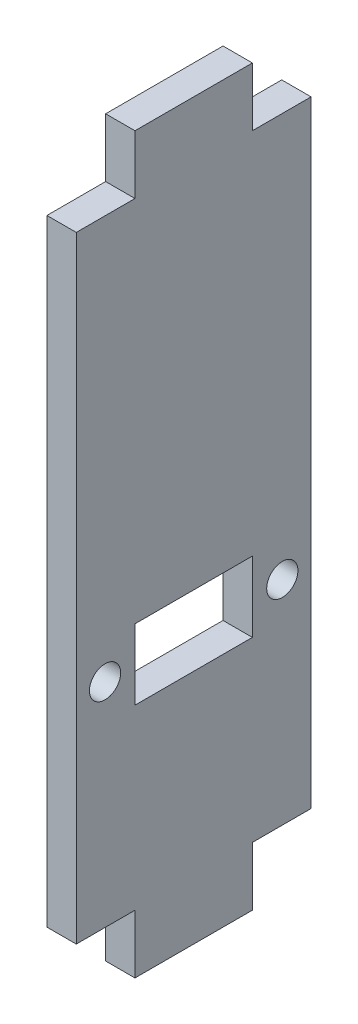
ISO-10303-21;
HEADER;
FILE_DESCRIPTION(('STEP AP214'),'2;1');
FILE_NAME('part.step','',(''),(''),'','','');
FILE_SCHEMA(('AUTOMOTIVE_DESIGN { 1 0 10303 214 1 1 1 1 }'));
ENDSEC;
DATA;
#1=APPLICATION_CONTEXT('core data for automotive mechanical design processes');
#2=APPLICATION_PROTOCOL_DEFINITION('international standard','automotive_design',2000,#1);
#3=PRODUCT_CONTEXT('',#1,'mechanical');
#4=PRODUCT('Part','Part','',(#3));
#5=PRODUCT_RELATED_PRODUCT_CATEGORY('part','',(#4));
#6=PRODUCT_DEFINITION_FORMATION('','',#4);
#7=PRODUCT_DEFINITION_CONTEXT('part definition',#1,'design');
#8=PRODUCT_DEFINITION('design','',#6,#7);
#9=PRODUCT_DEFINITION_SHAPE('','',#8);
#10=(LENGTH_UNIT() NAMED_UNIT(*) SI_UNIT(.MILLI.,.METRE.));
#11=(NAMED_UNIT(*) PLANE_ANGLE_UNIT() SI_UNIT($,.RADIAN.));
#12=(NAMED_UNIT(*) SI_UNIT($,.STERADIAN.) SOLID_ANGLE_UNIT());
#13=UNCERTAINTY_MEASURE_WITH_UNIT(LENGTH_MEASURE(1.E-05),#10,'distance_accuracy_value','');
#14=(GEOMETRIC_REPRESENTATION_CONTEXT(3) GLOBAL_UNCERTAINTY_ASSIGNED_CONTEXT((#13)) GLOBAL_UNIT_ASSIGNED_CONTEXT((#10,
#11,#12)) REPRESENTATION_CONTEXT('',''));
#15=CARTESIAN_POINT('',(0.,0.,0.));
#16=DIRECTION('',(0.,0.,1.));
#17=DIRECTION('',(1.,0.,0.));
#18=AXIS2_PLACEMENT_3D('',#15,#16,#17);
#19=CARTESIAN_POINT('',(3.175,6.35,12.7));
#20=DIRECTION('',(-1.,0.,0.));
#21=DIRECTION('',(0.,0.,1.));
#22=AXIS2_PLACEMENT_3D('',#19,#20,#21);
#23=PLANE('',#22);
#24=CARTESIAN_POINT('',(3.175,29.36875,-9.5885));
#25=DIRECTION('',(1.,0.,0.));
#26=DIRECTION('',(0.,0.,1.));
#27=AXIS2_PLACEMENT_3D('',#24,#25,#26);
#28=CIRCLE('',#27,1.6891);
#29=CARTESIAN_POINT('',(3.175,29.36875,-7.8994));
#30=VERTEX_POINT('',#29);
#31=EDGE_CURVE('E180',#30,#30,#28,.T.);
#32=ORIENTED_EDGE('',*,*,#31,.F.);
#33=EDGE_LOOP('',(#32));
#34=FACE_BOUND('',#33,.T.);
#35=DIRECTION('',(0.,-1.,0.));
#36=VECTOR('',#35,1.);
#37=CARTESIAN_POINT('',(3.175,73.025,12.7));
#38=LINE('',#37,#36);
#39=CARTESIAN_POINT('',(3.175,73.025,12.7));
#40=VERTEX_POINT('',#39);
#41=CARTESIAN_POINT('',(3.175,6.35,12.7));
#42=VERTEX_POINT('',#41);
#43=EDGE_CURVE('E192',#40,#42,#38,.T.);
#44=ORIENTED_EDGE('',*,*,#43,.T.);
#45=DIRECTION('',(0.,0.,-1.));
#46=VECTOR('',#45,1.);
#47=CARTESIAN_POINT('',(3.175,6.35,6.35));
#48=LINE('',#47,#46);
#49=CARTESIAN_POINT('',(3.175,6.35,6.35));
#50=VERTEX_POINT('',#49);
#51=EDGE_CURVE('E195',#42,#50,#48,.T.);
#52=ORIENTED_EDGE('',*,*,#51,.T.);
#53=DIRECTION('',(0.,-1.,0.));
#54=VECTOR('',#53,1.);
#55=CARTESIAN_POINT('',(3.175,0.,6.35));
#56=LINE('',#55,#54);
#57=CARTESIAN_POINT('',(3.175,0.,6.35));
#58=VERTEX_POINT('',#57);
#59=EDGE_CURVE('E198',#50,#58,#56,.T.);
#60=ORIENTED_EDGE('',*,*,#59,.T.);
#61=DIRECTION('',(0.,0.,-1.));
#62=VECTOR('',#61,1.);
#63=CARTESIAN_POINT('',(3.175,0.,6.35));
#64=LINE('',#63,#62);
#65=CARTESIAN_POINT('',(3.175,0.,-6.35));
#66=VERTEX_POINT('',#65);
#67=EDGE_CURVE('E200',#58,#66,#64,.T.);
#68=ORIENTED_EDGE('',*,*,#67,.T.);
#69=DIRECTION('',(0.,1.,0.));
#70=VECTOR('',#69,1.);
#71=CARTESIAN_POINT('',(3.175,0.,-6.35));
#72=LINE('',#71,#70);
#73=CARTESIAN_POINT('',(3.175,6.35,-6.35));
#74=VERTEX_POINT('',#73);
#75=EDGE_CURVE('E202',#66,#74,#72,.T.);
#76=ORIENTED_EDGE('',*,*,#75,.T.);
#77=DIRECTION('',(0.,0.,-1.));
#78=VECTOR('',#77,1.);
#79=CARTESIAN_POINT('',(3.175,6.35,-6.35));
#80=LINE('',#79,#78);
#81=CARTESIAN_POINT('',(3.175,6.35,-12.7));
#82=VERTEX_POINT('',#81);
#83=EDGE_CURVE('E204',#74,#82,#80,.T.);
#84=ORIENTED_EDGE('',*,*,#83,.T.);
#85=DIRECTION('',(0.,1.,0.));
#86=VECTOR('',#85,1.);
#87=CARTESIAN_POINT('',(3.175,73.025,-12.7));
#88=LINE('',#87,#86);
#89=CARTESIAN_POINT('',(3.175,73.025,-12.7));
#90=VERTEX_POINT('',#89);
#91=EDGE_CURVE('E206',#82,#90,#88,.T.);
#92=ORIENTED_EDGE('',*,*,#91,.T.);
#93=DIRECTION('',(0.,0.,1.));
#94=VECTOR('',#93,1.);
#95=CARTESIAN_POINT('',(3.175,73.025,-12.7));
#96=LINE('',#95,#94);
#97=CARTESIAN_POINT('',(3.175,73.025,-6.35));
#98=VERTEX_POINT('',#97);
#99=EDGE_CURVE('E208',#90,#98,#96,.T.);
#100=ORIENTED_EDGE('',*,*,#99,.T.);
#101=DIRECTION('',(0.,1.,0.));
#102=VECTOR('',#101,1.);
#103=CARTESIAN_POINT('',(3.175,73.025,-6.35));
#104=LINE('',#103,#102);
#105=CARTESIAN_POINT('',(3.175,79.375,-6.35));
#106=VERTEX_POINT('',#105);
#107=EDGE_CURVE('E210',#98,#106,#104,.T.);
#108=ORIENTED_EDGE('',*,*,#107,.T.);
#109=DIRECTION('',(0.,0.,1.));
#110=VECTOR('',#109,1.);
#111=CARTESIAN_POINT('',(3.175,79.375,6.35));
#112=LINE('',#111,#110);
#113=CARTESIAN_POINT('',(3.175,79.375,6.35));
#114=VERTEX_POINT('',#113);
#115=EDGE_CURVE('E212',#106,#114,#112,.T.);
#116=ORIENTED_EDGE('',*,*,#115,.T.);
#117=DIRECTION('',(0.,-1.,0.));
#118=VECTOR('',#117,1.);
#119=CARTESIAN_POINT('',(3.175,73.025,6.35));
#120=LINE('',#119,#118);
#121=CARTESIAN_POINT('',(3.175,73.025,6.35));
#122=VERTEX_POINT('',#121);
#123=EDGE_CURVE('E214',#114,#122,#120,.T.);
#124=ORIENTED_EDGE('',*,*,#123,.T.);
#125=DIRECTION('',(0.,0.,1.));
#126=VECTOR('',#125,1.);
#127=CARTESIAN_POINT('',(3.175,73.025,12.7));
#128=LINE('',#127,#126);
#129=EDGE_CURVE('E216',#122,#40,#128,.T.);
#130=ORIENTED_EDGE('',*,*,#129,.T.);
#131=EDGE_LOOP('',(#44,#52,#60,#68,#76,#84,#92,#100,#108,#116,#124,#130));
#132=FACE_BOUND('',#131,.T.);
#133=CARTESIAN_POINT('',(3.175,29.36875,9.5885));
#134=DIRECTION('',(1.,0.,0.));
#135=DIRECTION('',(0.,0.,-1.));
#136=AXIS2_PLACEMENT_3D('',#133,#134,#135);
#137=CIRCLE('',#136,1.6891);
#138=CARTESIAN_POINT('',(3.175,29.36875,7.8994));
#139=VERTEX_POINT('',#138);
#140=EDGE_CURVE('E186',#139,#139,#137,.T.);
#141=ORIENTED_EDGE('',*,*,#140,.F.);
#142=EDGE_LOOP('',(#141));
#143=FACE_BOUND('',#142,.T.);
#144=DIRECTION('',(0.,-1.,0.));
#145=VECTOR('',#144,1.);
#146=CARTESIAN_POINT('',(3.175,33.17875,6.35));
#147=LINE('',#146,#145);
#148=CARTESIAN_POINT('',(3.175,33.17875,6.35));
#149=VERTEX_POINT('',#148);
#150=CARTESIAN_POINT('',(3.175,25.55875,6.35));
#151=VERTEX_POINT('',#150);
#152=EDGE_CURVE('E144',#149,#151,#147,.T.);
#153=ORIENTED_EDGE('',*,*,#152,.F.);
#154=DIRECTION('',(0.,0.,1.));
#155=VECTOR('',#154,1.);
#156=CARTESIAN_POINT('',(3.175,33.17875,6.35));
#157=LINE('',#156,#155);
#158=CARTESIAN_POINT('',(3.175,33.17875,-6.35));
#159=VERTEX_POINT('',#158);
#160=EDGE_CURVE('E166',#159,#149,#157,.T.);
#161=ORIENTED_EDGE('',*,*,#160,.F.);
#162=DIRECTION('',(0.,1.,0.));
#163=VECTOR('',#162,1.);
#164=CARTESIAN_POINT('',(3.175,33.17875,-6.35));
#165=LINE('',#164,#163);
#166=CARTESIAN_POINT('',(3.175,25.55875,-6.35));
#167=VERTEX_POINT('',#166);
#168=EDGE_CURVE('E164',#167,#159,#165,.T.);
#169=ORIENTED_EDGE('',*,*,#168,.F.);
#170=DIRECTION('',(0.,0.,-1.));
#171=VECTOR('',#170,1.);
#172=CARTESIAN_POINT('',(3.175,25.55875,6.35));
#173=LINE('',#172,#171);
#174=EDGE_CURVE('E152',#151,#167,#173,.T.);
#175=ORIENTED_EDGE('',*,*,#174,.F.);
#176=EDGE_LOOP('',(#153,#161,#169,#175));
#177=FACE_BOUND('',#176,.T.);
#178=ADVANCED_FACE('F31',(#34,#132,#143,#177),#23,.F.);
#179=CARTESIAN_POINT('',(0.,6.35,12.7));
#180=DIRECTION('',(-1.,0.,0.));
#181=DIRECTION('',(0.,0.,1.));
#182=AXIS2_PLACEMENT_3D('',#179,#180,#181);
#183=PLANE('',#182);
#184=CARTESIAN_POINT('',(0.,29.36875,-9.5885));
#185=DIRECTION('',(1.,0.,0.));
#186=DIRECTION('',(0.,0.,1.));
#187=AXIS2_PLACEMENT_3D('',#184,#185,#186);
#188=CIRCLE('',#187,1.6891);
#189=CARTESIAN_POINT('',(0.,29.36875,-7.8994));
#190=VERTEX_POINT('',#189);
#191=EDGE_CURVE('E160',#190,#190,#188,.T.);
#192=ORIENTED_EDGE('',*,*,#191,.T.);
#193=EDGE_LOOP('',(#192));
#194=FACE_BOUND('',#193,.T.);
#195=DIRECTION('',(0.,-1.,0.));
#196=VECTOR('',#195,1.);
#197=CARTESIAN_POINT('',(0.,73.025,12.7));
#198=LINE('',#197,#196);
#199=CARTESIAN_POINT('',(0.,73.025,12.7));
#200=VERTEX_POINT('',#199);
#201=CARTESIAN_POINT('',(0.,6.35,12.7));
#202=VERTEX_POINT('',#201);
#203=EDGE_CURVE('E189',#200,#202,#198,.T.);
#204=ORIENTED_EDGE('',*,*,#203,.F.);
#205=DIRECTION('',(0.,0.,1.));
#206=VECTOR('',#205,1.);
#207=CARTESIAN_POINT('',(0.,73.025,12.7));
#208=LINE('',#207,#206);
#209=CARTESIAN_POINT('',(0.,73.025,6.35));
#210=VERTEX_POINT('',#209);
#211=EDGE_CURVE('E196',#210,#200,#208,.T.);
#212=ORIENTED_EDGE('',*,*,#211,.F.);
#213=DIRECTION('',(0.,-1.,0.));
#214=VECTOR('',#213,1.);
#215=CARTESIAN_POINT('',(0.,73.025,6.35));
#216=LINE('',#215,#214);
#217=CARTESIAN_POINT('',(0.,79.375,6.35));
#218=VERTEX_POINT('',#217);
#219=EDGE_CURVE('E239',#218,#210,#216,.T.);
#220=ORIENTED_EDGE('',*,*,#219,.F.);
#221=DIRECTION('',(0.,0.,1.));
#222=VECTOR('',#221,1.);
#223=CARTESIAN_POINT('',(0.,79.375,6.35));
#224=LINE('',#223,#222);
#225=CARTESIAN_POINT('',(0.,79.375,-6.35));
#226=VERTEX_POINT('',#225);
#227=EDGE_CURVE('E237',#226,#218,#224,.T.);
#228=ORIENTED_EDGE('',*,*,#227,.F.);
#229=DIRECTION('',(0.,1.,0.));
#230=VECTOR('',#229,1.);
#231=CARTESIAN_POINT('',(0.,73.025,-6.35));
#232=LINE('',#231,#230);
#233=CARTESIAN_POINT('',(0.,73.025,-6.35));
#234=VERTEX_POINT('',#233);
#235=EDGE_CURVE('E235',#234,#226,#232,.T.);
#236=ORIENTED_EDGE('',*,*,#235,.F.);
#237=DIRECTION('',(0.,0.,1.));
#238=VECTOR('',#237,1.);
#239=CARTESIAN_POINT('',(0.,73.025,-12.7));
#240=LINE('',#239,#238);
#241=CARTESIAN_POINT('',(0.,73.025,-12.7));
#242=VERTEX_POINT('',#241);
#243=EDGE_CURVE('E233',#242,#234,#240,.T.);
#244=ORIENTED_EDGE('',*,*,#243,.F.);
#245=DIRECTION('',(0.,1.,0.));
#246=VECTOR('',#245,1.);
#247=CARTESIAN_POINT('',(0.,73.025,-12.7));
#248=LINE('',#247,#246);
#249=CARTESIAN_POINT('',(0.,6.35,-12.7));
#250=VERTEX_POINT('',#249);
#251=EDGE_CURVE('E231',#250,#242,#248,.T.);
#252=ORIENTED_EDGE('',*,*,#251,.F.);
#253=DIRECTION('',(0.,0.,-1.));
#254=VECTOR('',#253,1.);
#255=CARTESIAN_POINT('',(0.,6.35,-6.35));
#256=LINE('',#255,#254);
#257=CARTESIAN_POINT('',(0.,6.35,-6.35));
#258=VERTEX_POINT('',#257);
#259=EDGE_CURVE('E229',#258,#250,#256,.T.);
#260=ORIENTED_EDGE('',*,*,#259,.F.);
#261=DIRECTION('',(0.,1.,0.));
#262=VECTOR('',#261,1.);
#263=CARTESIAN_POINT('',(0.,0.,-6.35));
#264=LINE('',#263,#262);
#265=CARTESIAN_POINT('',(0.,0.,-6.35));
#266=VERTEX_POINT('',#265);
#267=EDGE_CURVE('E227',#266,#258,#264,.T.);
#268=ORIENTED_EDGE('',*,*,#267,.F.);
#269=DIRECTION('',(0.,0.,-1.));
#270=VECTOR('',#269,1.);
#271=CARTESIAN_POINT('',(0.,0.,6.35));
#272=LINE('',#271,#270);
#273=CARTESIAN_POINT('',(0.,0.,6.35));
#274=VERTEX_POINT('',#273);
#275=EDGE_CURVE('E225',#274,#266,#272,.T.);
#276=ORIENTED_EDGE('',*,*,#275,.F.);
#277=DIRECTION('',(0.,-1.,0.));
#278=VECTOR('',#277,1.);
#279=CARTESIAN_POINT('',(0.,0.,6.35));
#280=LINE('',#279,#278);
#281=CARTESIAN_POINT('',(0.,6.35,6.35));
#282=VERTEX_POINT('',#281);
#283=EDGE_CURVE('E223',#282,#274,#280,.T.);
#284=ORIENTED_EDGE('',*,*,#283,.F.);
#285=DIRECTION('',(0.,0.,-1.));
#286=VECTOR('',#285,1.);
#287=CARTESIAN_POINT('',(0.,6.35,6.35));
#288=LINE('',#287,#286);
#289=EDGE_CURVE('E221',#202,#282,#288,.T.);
#290=ORIENTED_EDGE('',*,*,#289,.F.);
#291=EDGE_LOOP('',(#204,#212,#220,#228,#236,#244,#252,#260,#268,#276,#284,#290));
#292=FACE_BOUND('',#291,.T.);
#293=CARTESIAN_POINT('',(0.,29.36875,9.5885));
#294=DIRECTION('',(1.,0.,0.));
#295=DIRECTION('',(0.,0.,-1.));
#296=AXIS2_PLACEMENT_3D('',#293,#294,#295);
#297=CIRCLE('',#296,1.6891);
#298=CARTESIAN_POINT('',(0.,29.36875,7.8994));
#299=VERTEX_POINT('',#298);
#300=EDGE_CURVE('E183',#299,#299,#297,.T.);
#301=ORIENTED_EDGE('',*,*,#300,.T.);
#302=EDGE_LOOP('',(#301));
#303=FACE_BOUND('',#302,.T.);
#304=DIRECTION('',(0.,0.,1.));
#305=VECTOR('',#304,1.);
#306=CARTESIAN_POINT('',(0.,33.17875,6.35));
#307=LINE('',#306,#305);
#308=CARTESIAN_POINT('',(0.,33.17875,-6.35));
#309=VERTEX_POINT('',#308);
#310=CARTESIAN_POINT('',(0.,33.17875,6.35));
#311=VERTEX_POINT('',#310);
#312=EDGE_CURVE('E153',#309,#311,#307,.T.);
#313=ORIENTED_EDGE('',*,*,#312,.T.);
#314=DIRECTION('',(0.,-1.,0.));
#315=VECTOR('',#314,1.);
#316=CARTESIAN_POINT('',(0.,33.17875,6.35));
#317=LINE('',#316,#315);
#318=CARTESIAN_POINT('',(0.,25.55875,6.35));
#319=VERTEX_POINT('',#318);
#320=EDGE_CURVE('E54',#311,#319,#317,.T.);
#321=ORIENTED_EDGE('',*,*,#320,.T.);
#322=DIRECTION('',(0.,0.,-1.));
#323=VECTOR('',#322,1.);
#324=CARTESIAN_POINT('',(0.,25.55875,6.35));
#325=LINE('',#324,#323);
#326=CARTESIAN_POINT('',(0.,25.55875,-6.35));
#327=VERTEX_POINT('',#326);
#328=EDGE_CURVE('E159',#319,#327,#325,.T.);
#329=ORIENTED_EDGE('',*,*,#328,.T.);
#330=DIRECTION('',(0.,1.,0.));
#331=VECTOR('',#330,1.);
#332=CARTESIAN_POINT('',(0.,33.17875,-6.35));
#333=LINE('',#332,#331);
#334=EDGE_CURVE('E172',#327,#309,#333,.T.);
#335=ORIENTED_EDGE('',*,*,#334,.T.);
#336=EDGE_LOOP('',(#313,#321,#329,#335));
#337=FACE_BOUND('',#336,.T.);
#338=ADVANCED_FACE('F281',(#194,#292,#303,#337),#183,.T.);
#339=CARTESIAN_POINT('',(3.175,73.025,12.7));
#340=DIRECTION('',(0.,0.,-1.));
#341=DIRECTION('',(0.,1.,0.));
#342=AXIS2_PLACEMENT_3D('',#339,#340,#341);
#343=PLANE('',#342);
#344=ORIENTED_EDGE('',*,*,#203,.T.);
#345=DIRECTION('',(-1.,0.,0.));
#346=VECTOR('',#345,1.);
#347=CARTESIAN_POINT('',(3.175,6.35,12.7));
#348=LINE('',#347,#346);
#349=EDGE_CURVE('E11',#42,#202,#348,.T.);
#350=ORIENTED_EDGE('',*,*,#349,.F.);
#351=ORIENTED_EDGE('',*,*,#43,.F.);
#352=DIRECTION('',(-1.,0.,0.));
#353=VECTOR('',#352,1.);
#354=CARTESIAN_POINT('',(3.175,73.025,12.7));
#355=LINE('',#354,#353);
#356=EDGE_CURVE('E218',#40,#200,#355,.T.);
#357=ORIENTED_EDGE('',*,*,#356,.T.);
#358=EDGE_LOOP('',(#344,#350,#351,#357));
#359=FACE_BOUND('',#358,.T.);
#360=ADVANCED_FACE('F33',(#359),#343,.F.);
#361=CARTESIAN_POINT('',(3.175,6.35,6.35));
#362=DIRECTION('',(0.,1.,0.));
#363=DIRECTION('',(0.,0.,1.));
#364=AXIS2_PLACEMENT_3D('',#361,#362,#363);
#365=PLANE('',#364);
#366=ORIENTED_EDGE('',*,*,#289,.T.);
#367=DIRECTION('',(-1.,0.,0.));
#368=VECTOR('',#367,1.);
#369=CARTESIAN_POINT('',(3.175,6.35,6.35));
#370=LINE('',#369,#368);
#371=EDGE_CURVE('E39',#50,#282,#370,.T.);
#372=ORIENTED_EDGE('',*,*,#371,.F.);
#373=ORIENTED_EDGE('',*,*,#51,.F.);
#374=ORIENTED_EDGE('',*,*,#349,.T.);
#375=EDGE_LOOP('',(#366,#372,#373,#374));
#376=FACE_BOUND('',#375,.T.);
#377=ADVANCED_FACE('F299',(#376),#365,.F.);
#378=CARTESIAN_POINT('',(3.175,0.,6.35));
#379=DIRECTION('',(0.,0.,-1.));
#380=DIRECTION('',(-1.,0.,0.));
#381=AXIS2_PLACEMENT_3D('',#378,#379,#380);
#382=PLANE('',#381);
#383=ORIENTED_EDGE('',*,*,#283,.T.);
#384=DIRECTION('',(-1.,0.,0.));
#385=VECTOR('',#384,1.);
#386=CARTESIAN_POINT('',(3.175,0.,6.35));
#387=LINE('',#386,#385);
#388=EDGE_CURVE('E268',#58,#274,#387,.T.);
#389=ORIENTED_EDGE('',*,*,#388,.F.);
#390=ORIENTED_EDGE('',*,*,#59,.F.);
#391=ORIENTED_EDGE('',*,*,#371,.T.);
#392=EDGE_LOOP('',(#383,#389,#390,#391));
#393=FACE_BOUND('',#392,.T.);
#394=ADVANCED_FACE('F275',(#393),#382,.F.);
#395=CARTESIAN_POINT('',(3.175,0.,6.35));
#396=DIRECTION('',(0.,1.,0.));
#397=DIRECTION('',(0.,0.,1.));
#398=AXIS2_PLACEMENT_3D('',#395,#396,#397);
#399=PLANE('',#398);
#400=ORIENTED_EDGE('',*,*,#275,.T.);
#401=DIRECTION('',(-1.,0.,0.));
#402=VECTOR('',#401,1.);
#403=CARTESIAN_POINT('',(3.175,0.,-6.35));
#404=LINE('',#403,#402);
#405=EDGE_CURVE('E265',#66,#266,#404,.T.);
#406=ORIENTED_EDGE('',*,*,#405,.F.);
#407=ORIENTED_EDGE('',*,*,#67,.F.);
#408=ORIENTED_EDGE('',*,*,#388,.T.);
#409=EDGE_LOOP('',(#400,#406,#407,#408));
#410=FACE_BOUND('',#409,.T.);
#411=ADVANCED_FACE('F287',(#410),#399,.F.);
#412=CARTESIAN_POINT('',(3.175,0.,-6.35));
#413=DIRECTION('',(0.,0.,1.));
#414=DIRECTION('',(1.,0.,0.));
#415=AXIS2_PLACEMENT_3D('',#412,#413,#414);
#416=PLANE('',#415);
#417=ORIENTED_EDGE('',*,*,#267,.T.);
#418=DIRECTION('',(-1.,0.,0.));
#419=VECTOR('',#418,1.);
#420=CARTESIAN_POINT('',(3.175,6.35,-6.35));
#421=LINE('',#420,#419);
#422=EDGE_CURVE('E262',#74,#258,#421,.T.);
#423=ORIENTED_EDGE('',*,*,#422,.F.);
#424=ORIENTED_EDGE('',*,*,#75,.F.);
#425=ORIENTED_EDGE('',*,*,#405,.T.);
#426=EDGE_LOOP('',(#417,#423,#424,#425));
#427=FACE_BOUND('',#426,.T.);
#428=ADVANCED_FACE('F291',(#427),#416,.F.);
#429=CARTESIAN_POINT('',(3.175,6.35,-6.35));
#430=DIRECTION('',(0.,1.,0.));
#431=DIRECTION('',(0.,0.,1.));
#432=AXIS2_PLACEMENT_3D('',#429,#430,#431);
#433=PLANE('',#432);
#434=ORIENTED_EDGE('',*,*,#259,.T.);
#435=DIRECTION('',(-1.,0.,0.));
#436=VECTOR('',#435,1.);
#437=CARTESIAN_POINT('',(3.175,6.35,-12.7));
#438=LINE('',#437,#436);
#439=EDGE_CURVE('E259',#82,#250,#438,.T.);
#440=ORIENTED_EDGE('',*,*,#439,.F.);
#441=ORIENTED_EDGE('',*,*,#83,.F.);
#442=ORIENTED_EDGE('',*,*,#422,.T.);
#443=EDGE_LOOP('',(#434,#440,#441,#442));
#444=FACE_BOUND('',#443,.T.);
#445=ADVANCED_FACE('F332',(#444),#433,.F.);
#446=CARTESIAN_POINT('',(3.175,73.025,-12.7));
#447=DIRECTION('',(0.,0.,1.));
#448=DIRECTION('',(0.,-1.,0.));
#449=AXIS2_PLACEMENT_3D('',#446,#447,#448);
#450=PLANE('',#449);
#451=ORIENTED_EDGE('',*,*,#251,.T.);
#452=DIRECTION('',(-1.,0.,0.));
#453=VECTOR('',#452,1.);
#454=CARTESIAN_POINT('',(3.175,73.025,-12.7));
#455=LINE('',#454,#453);
#456=EDGE_CURVE('E256',#90,#242,#455,.T.);
#457=ORIENTED_EDGE('',*,*,#456,.F.);
#458=ORIENTED_EDGE('',*,*,#91,.F.);
#459=ORIENTED_EDGE('',*,*,#439,.T.);
#460=EDGE_LOOP('',(#451,#457,#458,#459));
#461=FACE_BOUND('',#460,.T.);
#462=ADVANCED_FACE('F330',(#461),#450,.F.);
#463=CARTESIAN_POINT('',(3.175,73.025,-12.7));
#464=DIRECTION('',(0.,-1.,0.));
#465=DIRECTION('',(0.,0.,-1.));
#466=AXIS2_PLACEMENT_3D('',#463,#464,#465);
#467=PLANE('',#466);
#468=ORIENTED_EDGE('',*,*,#243,.T.);
#469=DIRECTION('',(-1.,0.,0.));
#470=VECTOR('',#469,1.);
#471=CARTESIAN_POINT('',(3.175,73.025,-6.35));
#472=LINE('',#471,#470);
#473=EDGE_CURVE('E253',#98,#234,#472,.T.);
#474=ORIENTED_EDGE('',*,*,#473,.F.);
#475=ORIENTED_EDGE('',*,*,#99,.F.);
#476=ORIENTED_EDGE('',*,*,#456,.T.);
#477=EDGE_LOOP('',(#468,#474,#475,#476));
#478=FACE_BOUND('',#477,.T.);
#479=ADVANCED_FACE('F326',(#478),#467,.F.);
#480=CARTESIAN_POINT('',(3.175,73.025,-6.35));
#481=DIRECTION('',(0.,0.,1.));
#482=DIRECTION('',(0.,-1.,0.));
#483=AXIS2_PLACEMENT_3D('',#480,#481,#482);
#484=PLANE('',#483);
#485=ORIENTED_EDGE('',*,*,#235,.T.);
#486=DIRECTION('',(-1.,0.,0.));
#487=VECTOR('',#486,1.);
#488=CARTESIAN_POINT('',(3.175,79.375,-6.35));
#489=LINE('',#488,#487);
#490=EDGE_CURVE('E250',#106,#226,#489,.T.);
#491=ORIENTED_EDGE('',*,*,#490,.F.);
#492=ORIENTED_EDGE('',*,*,#107,.F.);
#493=ORIENTED_EDGE('',*,*,#473,.T.);
#494=EDGE_LOOP('',(#485,#491,#492,#493));
#495=FACE_BOUND('',#494,.T.);
#496=ADVANCED_FACE('F321',(#495),#484,.F.);
#497=CARTESIAN_POINT('',(3.175,79.375,6.35));
#498=DIRECTION('',(0.,-1.,0.));
#499=DIRECTION('',(0.,0.,-1.));
#500=AXIS2_PLACEMENT_3D('',#497,#498,#499);
#501=PLANE('',#500);
#502=ORIENTED_EDGE('',*,*,#227,.T.);
#503=DIRECTION('',(-1.,0.,0.));
#504=VECTOR('',#503,1.);
#505=CARTESIAN_POINT('',(3.175,79.375,6.35));
#506=LINE('',#505,#504);
#507=EDGE_CURVE('E247',#114,#218,#506,.T.);
#508=ORIENTED_EDGE('',*,*,#507,.F.);
#509=ORIENTED_EDGE('',*,*,#115,.F.);
#510=ORIENTED_EDGE('',*,*,#490,.T.);
#511=EDGE_LOOP('',(#502,#508,#509,#510));
#512=FACE_BOUND('',#511,.T.);
#513=ADVANCED_FACE('F315',(#512),#501,.F.);
#514=CARTESIAN_POINT('',(3.175,73.025,6.35));
#515=DIRECTION('',(0.,0.,-1.));
#516=DIRECTION('',(0.,1.,0.));
#517=AXIS2_PLACEMENT_3D('',#514,#515,#516);
#518=PLANE('',#517);
#519=ORIENTED_EDGE('',*,*,#219,.T.);
#520=DIRECTION('',(-1.,0.,0.));
#521=VECTOR('',#520,1.);
#522=CARTESIAN_POINT('',(3.175,73.025,6.35));
#523=LINE('',#522,#521);
#524=EDGE_CURVE('E244',#122,#210,#523,.T.);
#525=ORIENTED_EDGE('',*,*,#524,.F.);
#526=ORIENTED_EDGE('',*,*,#123,.F.);
#527=ORIENTED_EDGE('',*,*,#507,.T.);
#528=EDGE_LOOP('',(#519,#525,#526,#527));
#529=FACE_BOUND('',#528,.T.);
#530=ADVANCED_FACE('F311',(#529),#518,.F.);
#531=CARTESIAN_POINT('',(3.175,73.025,12.7));
#532=DIRECTION('',(0.,-1.,0.));
#533=DIRECTION('',(0.,0.,-1.));
#534=AXIS2_PLACEMENT_3D('',#531,#532,#533);
#535=PLANE('',#534);
#536=ORIENTED_EDGE('',*,*,#211,.T.);
#537=ORIENTED_EDGE('',*,*,#356,.F.);
#538=ORIENTED_EDGE('',*,*,#129,.F.);
#539=ORIENTED_EDGE('',*,*,#524,.T.);
#540=EDGE_LOOP('',(#536,#537,#538,#539));
#541=FACE_BOUND('',#540,.T.);
#542=ADVANCED_FACE('F306',(#541),#535,.F.);
#543=CARTESIAN_POINT('',(3.175,29.36875,9.5885));
#544=DIRECTION('',(-1.,0.,0.));
#545=DIRECTION('',(0.,0.,1.));
#546=AXIS2_PLACEMENT_3D('',#543,#544,#545);
#547=CYLINDRICAL_SURFACE('',#546,1.6891);
#548=ORIENTED_EDGE('',*,*,#140,.T.);
#549=EDGE_LOOP('',(#548));
#550=FACE_BOUND('',#549,.T.);
#551=ORIENTED_EDGE('',*,*,#300,.F.);
#552=EDGE_LOOP('',(#551));
#553=FACE_BOUND('',#552,.T.);
#554=ADVANCED_FACE('F351',(#550,#553),#547,.F.);
#555=CARTESIAN_POINT('',(3.175,29.36875,-9.5885));
#556=DIRECTION('',(-1.,0.,0.));
#557=DIRECTION('',(0.,0.,1.));
#558=AXIS2_PLACEMENT_3D('',#555,#556,#557);
#559=CYLINDRICAL_SURFACE('',#558,1.6891);
#560=ORIENTED_EDGE('',*,*,#31,.T.);
#561=EDGE_LOOP('',(#560));
#562=FACE_BOUND('',#561,.T.);
#563=ORIENTED_EDGE('',*,*,#191,.F.);
#564=EDGE_LOOP('',(#563));
#565=FACE_BOUND('',#564,.T.);
#566=ADVANCED_FACE('F389',(#562,#565),#559,.F.);
#567=CARTESIAN_POINT('',(3.175,33.17875,6.35));
#568=DIRECTION('',(0.,0.,-1.));
#569=DIRECTION('',(0.,1.,0.));
#570=AXIS2_PLACEMENT_3D('',#567,#568,#569);
#571=PLANE('',#570);
#572=ORIENTED_EDGE('',*,*,#320,.F.);
#573=DIRECTION('',(-1.,0.,0.));
#574=VECTOR('',#573,1.);
#575=CARTESIAN_POINT('',(3.175,33.17875,6.35));
#576=LINE('',#575,#574);
#577=EDGE_CURVE('E148',#149,#311,#576,.T.);
#578=ORIENTED_EDGE('',*,*,#577,.F.);
#579=ORIENTED_EDGE('',*,*,#152,.T.);
#580=DIRECTION('',(-1.,0.,0.));
#581=VECTOR('',#580,1.);
#582=CARTESIAN_POINT('',(3.175,25.55875,6.35));
#583=LINE('',#582,#581);
#584=EDGE_CURVE('E147',#151,#319,#583,.T.);
#585=ORIENTED_EDGE('',*,*,#584,.T.);
#586=EDGE_LOOP('',(#572,#578,#579,#585));
#587=FACE_BOUND('',#586,.T.);
#588=ADVANCED_FACE('F146',(#587),#571,.T.);
#589=CARTESIAN_POINT('',(3.175,25.55875,6.35));
#590=DIRECTION('',(0.,1.,0.));
#591=DIRECTION('',(0.,0.,1.));
#592=AXIS2_PLACEMENT_3D('',#589,#590,#591);
#593=PLANE('',#592);
#594=ORIENTED_EDGE('',*,*,#328,.F.);
#595=ORIENTED_EDGE('',*,*,#584,.F.);
#596=ORIENTED_EDGE('',*,*,#174,.T.);
#597=DIRECTION('',(-1.,0.,0.));
#598=VECTOR('',#597,1.);
#599=CARTESIAN_POINT('',(3.175,25.55875,-6.35));
#600=LINE('',#599,#598);
#601=EDGE_CURVE('E161',#167,#327,#600,.T.);
#602=ORIENTED_EDGE('',*,*,#601,.T.);
#603=EDGE_LOOP('',(#594,#595,#596,#602));
#604=FACE_BOUND('',#603,.T.);
#605=ADVANCED_FACE('F156',(#604),#593,.T.);
#606=CARTESIAN_POINT('',(3.175,33.17875,-6.35));
#607=DIRECTION('',(0.,0.,1.));
#608=DIRECTION('',(0.,-1.,0.));
#609=AXIS2_PLACEMENT_3D('',#606,#607,#608);
#610=PLANE('',#609);
#611=ORIENTED_EDGE('',*,*,#334,.F.);
#612=ORIENTED_EDGE('',*,*,#601,.F.);
#613=ORIENTED_EDGE('',*,*,#168,.T.);
#614=DIRECTION('',(-1.,0.,0.));
#615=VECTOR('',#614,1.);
#616=CARTESIAN_POINT('',(3.175,33.17875,-6.35));
#617=LINE('',#616,#615);
#618=EDGE_CURVE('E46',#159,#309,#617,.T.);
#619=ORIENTED_EDGE('',*,*,#618,.T.);
#620=EDGE_LOOP('',(#611,#612,#613,#619));
#621=FACE_BOUND('',#620,.T.);
#622=ADVANCED_FACE('F408',(#621),#610,.T.);
#623=CARTESIAN_POINT('',(3.175,33.17875,6.35));
#624=DIRECTION('',(0.,-1.,0.));
#625=DIRECTION('',(0.,0.,-1.));
#626=AXIS2_PLACEMENT_3D('',#623,#624,#625);
#627=PLANE('',#626);
#628=ORIENTED_EDGE('',*,*,#312,.F.);
#629=ORIENTED_EDGE('',*,*,#618,.F.);
#630=ORIENTED_EDGE('',*,*,#160,.T.);
#631=ORIENTED_EDGE('',*,*,#577,.T.);
#632=EDGE_LOOP('',(#628,#629,#630,#631));
#633=FACE_BOUND('',#632,.T.);
#634=ADVANCED_FACE('F415',(#633),#627,.T.);
#635=CLOSED_SHELL('',(#178,#338,#360,#377,#394,#411,#428,#445,#462,#479,#496,#513,#530,#542,
#554,#566,#588,#605,#622,#634));
#636=MANIFOLD_SOLID_BREP('B2',#635);
#637=ADVANCED_BREP_SHAPE_REPRESENTATION('',(#18,#636),#14);
#638=SHAPE_DEFINITION_REPRESENTATION(#9,#637);
ENDSEC;
END-ISO-10303-21;
